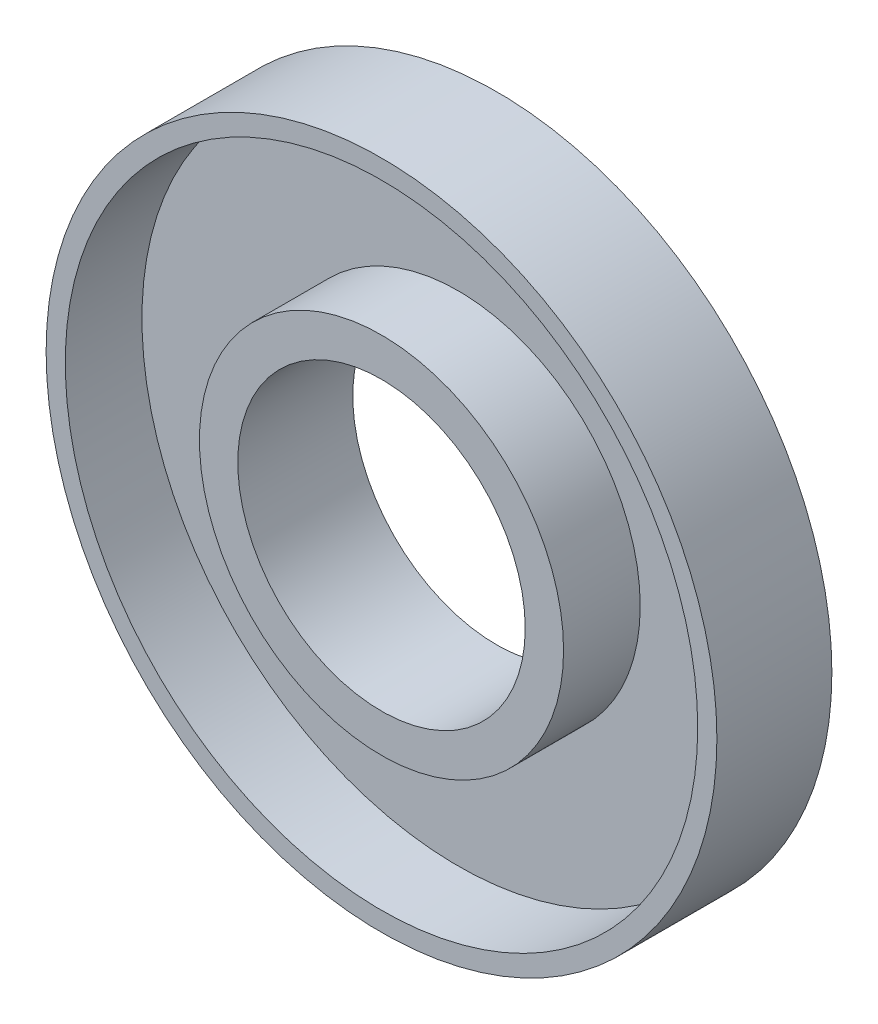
ISO-10303-21;
HEADER;
FILE_DESCRIPTION(('STEP AP214'),'2;1');
FILE_NAME('part.step','',(''),(''),'','','');
FILE_SCHEMA(('AUTOMOTIVE_DESIGN { 1 0 10303 214 1 1 1 1 }'));
ENDSEC;
DATA;
#1=APPLICATION_CONTEXT('core data for automotive mechanical design processes');
#2=APPLICATION_PROTOCOL_DEFINITION('international standard','automotive_design',2000,#1);
#3=PRODUCT_CONTEXT('',#1,'mechanical');
#4=PRODUCT('Part','Part','',(#3));
#5=PRODUCT_RELATED_PRODUCT_CATEGORY('part','',(#4));
#6=PRODUCT_DEFINITION_FORMATION('','',#4);
#7=PRODUCT_DEFINITION_CONTEXT('part definition',#1,'design');
#8=PRODUCT_DEFINITION('design','',#6,#7);
#9=PRODUCT_DEFINITION_SHAPE('','',#8);
#10=(LENGTH_UNIT() NAMED_UNIT(*) SI_UNIT(.MILLI.,.METRE.));
#11=(NAMED_UNIT(*) PLANE_ANGLE_UNIT() SI_UNIT($,.RADIAN.));
#12=(NAMED_UNIT(*) SI_UNIT($,.STERADIAN.) SOLID_ANGLE_UNIT());
#13=UNCERTAINTY_MEASURE_WITH_UNIT(LENGTH_MEASURE(1.E-05),#10,'distance_accuracy_value','');
#14=(GEOMETRIC_REPRESENTATION_CONTEXT(3) GLOBAL_UNCERTAINTY_ASSIGNED_CONTEXT((#13)) GLOBAL_UNIT_ASSIGNED_CONTEXT((#10,
#11,#12)) REPRESENTATION_CONTEXT('',''));
#15=CARTESIAN_POINT('',(0.,0.,0.));
#16=DIRECTION('',(0.,0.,1.));
#17=DIRECTION('',(1.,0.,0.));
#18=AXIS2_PLACEMENT_3D('',#15,#16,#17);
#19=CARTESIAN_POINT('',(0.,0.,2.));
#20=DIRECTION('',(0.,0.,1.));
#21=DIRECTION('',(1.,0.,0.));
#22=AXIS2_PLACEMENT_3D('',#19,#20,#21);
#23=PLANE('',#22);
#24=CARTESIAN_POINT('',(0.,0.,2.));
#25=DIRECTION('',(0.,0.,1.));
#26=DIRECTION('',(1.,0.,0.));
#27=AXIS2_PLACEMENT_3D('',#24,#25,#26);
#28=CIRCLE('',#27,16.5);
#29=CARTESIAN_POINT('',(16.5,0.,2.));
#30=VERTEX_POINT('',#29);
#31=EDGE_CURVE('E10',#30,#30,#28,.F.);
#32=ORIENTED_EDGE('',*,*,#31,.F.);
#33=EDGE_LOOP('',(#32));
#34=FACE_BOUND('',#33,.T.);
#35=CARTESIAN_POINT('',(0.,0.,2.));
#36=DIRECTION('',(0.,0.,1.));
#37=DIRECTION('',(1.,0.,0.));
#38=AXIS2_PLACEMENT_3D('',#35,#36,#37);
#39=CIRCLE('',#38,9.5);
#40=CARTESIAN_POINT('',(9.5,0.,2.));
#41=VERTEX_POINT('',#40);
#42=EDGE_CURVE('E55',#41,#41,#39,.T.);
#43=ORIENTED_EDGE('',*,*,#42,.F.);
#44=EDGE_LOOP('',(#43));
#45=FACE_BOUND('',#44,.T.);
#46=ADVANCED_FACE('F31',(#34,#45),#23,.T.);
#47=CARTESIAN_POINT('',(0.,0.,0.));
#48=DIRECTION('',(0.,0.,1.));
#49=DIRECTION('',(1.,0.,0.));
#50=AXIS2_PLACEMENT_3D('',#47,#48,#49);
#51=PLANE('',#50);
#52=CARTESIAN_POINT('',(0.,0.,0.));
#53=DIRECTION('',(0.,0.,1.));
#54=DIRECTION('',(1.,0.,0.));
#55=AXIS2_PLACEMENT_3D('',#52,#53,#54);
#56=CIRCLE('',#55,17.5);
#57=CARTESIAN_POINT('',(17.5,0.,0.));
#58=VERTEX_POINT('',#57);
#59=EDGE_CURVE('E38',#58,#58,#56,.T.);
#60=ORIENTED_EDGE('',*,*,#59,.F.);
#61=EDGE_LOOP('',(#60));
#62=FACE_BOUND('',#61,.T.);
#63=CARTESIAN_POINT('',(0.,0.,0.));
#64=DIRECTION('',(0.,0.,1.));
#65=DIRECTION('',(1.,0.,0.));
#66=AXIS2_PLACEMENT_3D('',#63,#64,#65);
#67=CIRCLE('',#66,7.5);
#68=CARTESIAN_POINT('',(7.5,0.,0.));
#69=VERTEX_POINT('',#68);
#70=EDGE_CURVE('E42',#69,#69,#67,.T.);
#71=ORIENTED_EDGE('',*,*,#70,.T.);
#72=EDGE_LOOP('',(#71));
#73=FACE_BOUND('',#72,.T.);
#74=ADVANCED_FACE('F82',(#62,#73),#51,.F.);
#75=CARTESIAN_POINT('',(0.,0.,2.));
#76=DIRECTION('',(0.,0.,-1.));
#77=DIRECTION('',(-1.,0.,0.));
#78=AXIS2_PLACEMENT_3D('',#75,#76,#77);
#79=CYLINDRICAL_SURFACE('',#78,17.5);
#80=ORIENTED_EDGE('',*,*,#59,.T.);
#81=EDGE_LOOP('',(#80));
#82=FACE_BOUND('',#81,.T.);
#83=CARTESIAN_POINT('',(0.,0.,6.));
#84=DIRECTION('',(0.,0.,1.));
#85=DIRECTION('',(1.,0.,0.));
#86=AXIS2_PLACEMENT_3D('',#83,#84,#85);
#87=CIRCLE('',#86,17.5);
#88=CARTESIAN_POINT('',(17.5,0.,6.));
#89=VERTEX_POINT('',#88);
#90=EDGE_CURVE('E46',#89,#89,#87,.T.);
#91=ORIENTED_EDGE('',*,*,#90,.F.);
#92=EDGE_LOOP('',(#91));
#93=FACE_BOUND('',#92,.T.);
#94=ADVANCED_FACE('F33',(#82,#93),#79,.T.);
#95=CARTESIAN_POINT('',(0.,0.,2.));
#96=DIRECTION('',(0.,0.,-1.));
#97=DIRECTION('',(-1.,0.,0.));
#98=AXIS2_PLACEMENT_3D('',#95,#96,#97);
#99=CYLINDRICAL_SURFACE('',#98,7.5);
#100=ORIENTED_EDGE('',*,*,#70,.F.);
#101=EDGE_LOOP('',(#100));
#102=FACE_BOUND('',#101,.T.);
#103=CARTESIAN_POINT('',(0.,0.,6.));
#104=DIRECTION('',(0.,0.,1.));
#105=DIRECTION('',(1.,0.,0.));
#106=AXIS2_PLACEMENT_3D('',#103,#104,#105);
#107=CIRCLE('',#106,7.5);
#108=CARTESIAN_POINT('',(7.5,0.,6.));
#109=VERTEX_POINT('',#108);
#110=EDGE_CURVE('E58',#109,#109,#107,.T.);
#111=ORIENTED_EDGE('',*,*,#110,.T.);
#112=EDGE_LOOP('',(#111));
#113=FACE_BOUND('',#112,.T.);
#114=ADVANCED_FACE('F64',(#102,#113),#99,.F.);
#115=CARTESIAN_POINT('',(0.,0.,6.));
#116=DIRECTION('',(0.,0.,1.));
#117=DIRECTION('',(1.,0.,0.));
#118=AXIS2_PLACEMENT_3D('',#115,#116,#117);
#119=PLANE('',#118);
#120=ORIENTED_EDGE('',*,*,#90,.T.);
#121=EDGE_LOOP('',(#120));
#122=FACE_BOUND('',#121,.T.);
#123=CARTESIAN_POINT('',(0.,0.,6.));
#124=DIRECTION('',(0.,0.,1.));
#125=DIRECTION('',(1.,0.,0.));
#126=AXIS2_PLACEMENT_3D('',#123,#124,#125);
#127=CIRCLE('',#126,16.5);
#128=CARTESIAN_POINT('',(16.5,0.,6.));
#129=VERTEX_POINT('',#128);
#130=EDGE_CURVE('E51',#129,#129,#127,.T.);
#131=ORIENTED_EDGE('',*,*,#130,.F.);
#132=EDGE_LOOP('',(#131));
#133=FACE_BOUND('',#132,.T.);
#134=ADVANCED_FACE('F78',(#122,#133),#119,.T.);
#135=CARTESIAN_POINT('',(0.,0.,6.));
#136=DIRECTION('',(0.,0.,-1.));
#137=DIRECTION('',(-1.,0.,0.));
#138=AXIS2_PLACEMENT_3D('',#135,#136,#137);
#139=CYLINDRICAL_SURFACE('',#138,16.5);
#140=ORIENTED_EDGE('',*,*,#130,.T.);
#141=EDGE_LOOP('',(#140));
#142=FACE_BOUND('',#141,.T.);
#143=ORIENTED_EDGE('',*,*,#31,.T.);
#144=EDGE_LOOP('',(#143));
#145=FACE_BOUND('',#144,.T.);
#146=ADVANCED_FACE('F69',(#142,#145),#139,.F.);
#147=CARTESIAN_POINT('',(0.,0.,6.));
#148=DIRECTION('',(0.,0.,1.));
#149=DIRECTION('',(1.,0.,0.));
#150=AXIS2_PLACEMENT_3D('',#147,#148,#149);
#151=PLANE('',#150);
#152=CARTESIAN_POINT('',(0.,0.,6.));
#153=DIRECTION('',(0.,0.,1.));
#154=DIRECTION('',(1.,0.,0.));
#155=AXIS2_PLACEMENT_3D('',#152,#153,#154);
#156=CIRCLE('',#155,9.5);
#157=CARTESIAN_POINT('',(9.5,0.,6.));
#158=VERTEX_POINT('',#157);
#159=EDGE_CURVE('E54',#158,#158,#156,.T.);
#160=ORIENTED_EDGE('',*,*,#159,.T.);
#161=EDGE_LOOP('',(#160));
#162=FACE_BOUND('',#161,.T.);
#163=ORIENTED_EDGE('',*,*,#110,.F.);
#164=EDGE_LOOP('',(#163));
#165=FACE_BOUND('',#164,.T.);
#166=ADVANCED_FACE('F66',(#162,#165),#151,.T.);
#167=CARTESIAN_POINT('',(0.,0.,6.));
#168=DIRECTION('',(0.,0.,-1.));
#169=DIRECTION('',(-1.,0.,0.));
#170=AXIS2_PLACEMENT_3D('',#167,#168,#169);
#171=CYLINDRICAL_SURFACE('',#170,9.5);
#172=ORIENTED_EDGE('',*,*,#159,.F.);
#173=EDGE_LOOP('',(#172));
#174=FACE_BOUND('',#173,.T.);
#175=ORIENTED_EDGE('',*,*,#42,.T.);
#176=EDGE_LOOP('',(#175));
#177=FACE_BOUND('',#176,.T.);
#178=ADVANCED_FACE('F68',(#174,#177),#171,.T.);
#179=CLOSED_SHELL('',(#46,#74,#94,#114,#134,#146,#166,#178));
#180=MANIFOLD_SOLID_BREP('B2',#179);
#181=ADVANCED_BREP_SHAPE_REPRESENTATION('',(#18,#180),#14);
#182=SHAPE_DEFINITION_REPRESENTATION(#9,#181);
ENDSEC;
END-ISO-10303-21;
